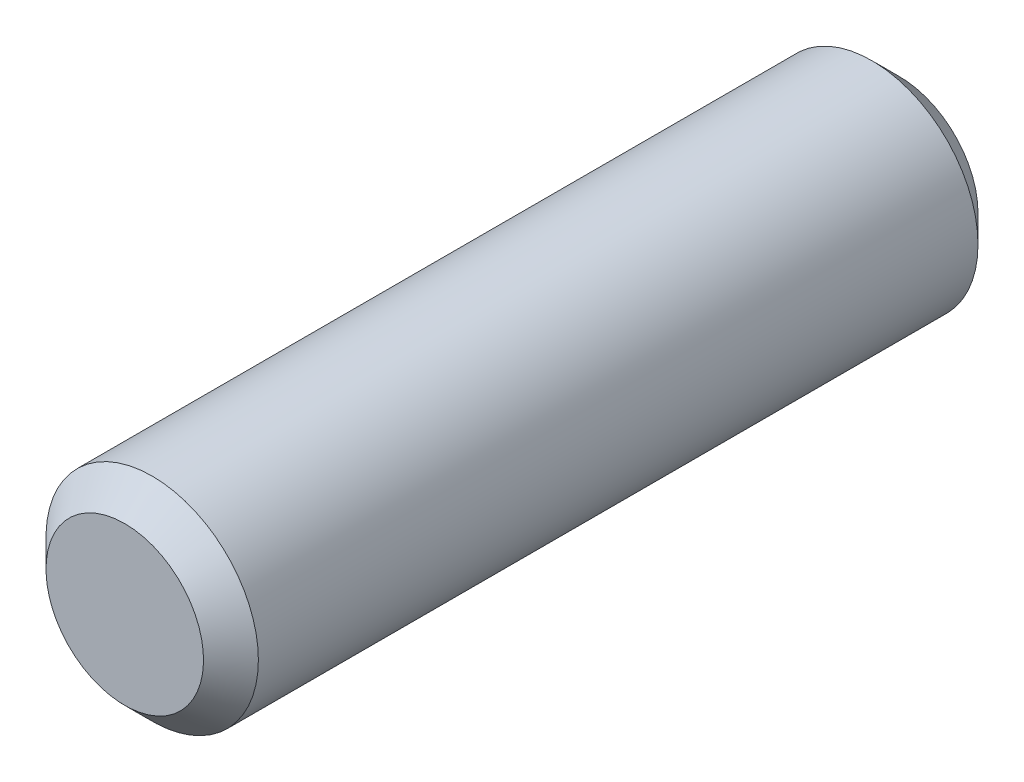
ISO-10303-21;
HEADER;
FILE_DESCRIPTION(('STEP AP214'),'2;1');
FILE_NAME('part.step','',(''),(''),'','','');
FILE_SCHEMA(('AUTOMOTIVE_DESIGN { 1 0 10303 214 1 1 1 1 }'));
ENDSEC;
DATA;
#1=APPLICATION_CONTEXT('core data for automotive mechanical design processes');
#2=APPLICATION_PROTOCOL_DEFINITION('international standard','automotive_design',2000,#1);
#3=PRODUCT_CONTEXT('',#1,'mechanical');
#4=PRODUCT('Part','Part','',(#3));
#5=PRODUCT_RELATED_PRODUCT_CATEGORY('part','',(#4));
#6=PRODUCT_DEFINITION_FORMATION('','',#4);
#7=PRODUCT_DEFINITION_CONTEXT('part definition',#1,'design');
#8=PRODUCT_DEFINITION('design','',#6,#7);
#9=PRODUCT_DEFINITION_SHAPE('','',#8);
#10=(LENGTH_UNIT() NAMED_UNIT(*) SI_UNIT(.MILLI.,.METRE.));
#11=(NAMED_UNIT(*) PLANE_ANGLE_UNIT() SI_UNIT($,.RADIAN.));
#12=(NAMED_UNIT(*) SI_UNIT($,.STERADIAN.) SOLID_ANGLE_UNIT());
#13=UNCERTAINTY_MEASURE_WITH_UNIT(LENGTH_MEASURE(1.E-05),#10,'distance_accuracy_value','');
#14=(GEOMETRIC_REPRESENTATION_CONTEXT(3) GLOBAL_UNCERTAINTY_ASSIGNED_CONTEXT((#13)) GLOBAL_UNIT_ASSIGNED_CONTEXT((#10,
#11,#12)) REPRESENTATION_CONTEXT('',''));
#15=CARTESIAN_POINT('',(0.,0.,0.));
#16=DIRECTION('',(0.,0.,1.));
#17=DIRECTION('',(1.,0.,0.));
#18=AXIS2_PLACEMENT_3D('',#15,#16,#17);
#19=CARTESIAN_POINT('',(0.,0.,29.6418));
#20=DIRECTION('',(0.,0.,1.));
#21=DIRECTION('',(1.,0.,0.));
#22=AXIS2_PLACEMENT_3D('',#19,#20,#21);
#23=PLANE('',#22);
#24=CARTESIAN_POINT('',(0.,0.,29.6418));
#25=DIRECTION('',(0.,0.,-1.));
#26=DIRECTION('',(0.,1.,0.));
#27=AXIS2_PLACEMENT_3D('',#24,#25,#26);
#28=CIRCLE('',#27,3.01413333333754);
#29=CARTESIAN_POINT('',(0.,3.01413333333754,29.6418));
#30=VERTEX_POINT('',#29);
#31=EDGE_CURVE('E18',#30,#30,#28,.T.);
#32=ORIENTED_EDGE('',*,*,#31,.F.);
#33=EDGE_LOOP('',(#32));
#34=FACE_BOUND('',#33,.T.);
#35=ADVANCED_FACE('F15',(#34),#23,.T.);
#36=CARTESIAN_POINT('',(0.,0.,0.));
#37=DIRECTION('',(0.,0.,1.));
#38=DIRECTION('',(1.,0.,0.));
#39=AXIS2_PLACEMENT_3D('',#36,#37,#38);
#40=PLANE('',#39);
#41=CARTESIAN_POINT('',(0.,0.,0.));
#42=DIRECTION('',(0.,0.,1.));
#43=DIRECTION('',(1.,0.,0.));
#44=AXIS2_PLACEMENT_3D('',#41,#42,#43);
#45=CIRCLE('',#44,3.01413333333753);
#46=CARTESIAN_POINT('',(3.01413333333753,0.,0.));
#47=VERTEX_POINT('',#46);
#48=EDGE_CURVE('E27',#47,#47,#45,.T.);
#49=ORIENTED_EDGE('',*,*,#48,.F.);
#50=EDGE_LOOP('',(#49));
#51=FACE_BOUND('',#50,.T.);
#52=ADVANCED_FACE('F38',(#51),#40,.F.);
#53=CARTESIAN_POINT('',(0.,0.,28.5919333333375));
#54=DIRECTION('',(0.,0.,-1.));
#55=DIRECTION('',(0.,1.,0.));
#56=AXIS2_PLACEMENT_3D('',#53,#54,#55);
#57=CONICAL_SURFACE('',#56,4.064,0.785398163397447);
#58=CARTESIAN_POINT('',(0.,0.,28.5919333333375));
#59=DIRECTION('',(0.,0.,1.));
#60=DIRECTION('',(1.,0.,0.));
#61=AXIS2_PLACEMENT_3D('',#58,#59,#60);
#62=CIRCLE('',#61,4.064);
#63=CARTESIAN_POINT('',(4.064,0.,28.5919333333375));
#64=VERTEX_POINT('',#63);
#65=EDGE_CURVE('E22',#64,#64,#62,.F.);
#66=ORIENTED_EDGE('',*,*,#65,.F.);
#67=EDGE_LOOP('',(#66));
#68=FACE_BOUND('',#67,.T.);
#69=ORIENTED_EDGE('',*,*,#31,.T.);
#70=EDGE_LOOP('',(#69));
#71=FACE_BOUND('',#70,.T.);
#72=ADVANCED_FACE('F35',(#68,#71),#57,.T.);
#73=CARTESIAN_POINT('',(0.,0.,1.04986666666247));
#74=DIRECTION('',(0.,0.,1.));
#75=DIRECTION('',(1.,0.,0.));
#76=AXIS2_PLACEMENT_3D('',#73,#74,#75);
#77=CONICAL_SURFACE('',#76,4.064,0.785398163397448);
#78=CARTESIAN_POINT('',(0.,0.,1.04986666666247));
#79=DIRECTION('',(0.,0.,1.));
#80=DIRECTION('',(1.,0.,0.));
#81=AXIS2_PLACEMENT_3D('',#78,#79,#80);
#82=CIRCLE('',#81,4.064);
#83=CARTESIAN_POINT('',(4.064,0.,1.04986666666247));
#84=VERTEX_POINT('',#83);
#85=EDGE_CURVE('E10',#84,#84,#82,.T.);
#86=ORIENTED_EDGE('',*,*,#85,.F.);
#87=EDGE_LOOP('',(#86));
#88=FACE_BOUND('',#87,.T.);
#89=ORIENTED_EDGE('',*,*,#48,.T.);
#90=EDGE_LOOP('',(#89));
#91=FACE_BOUND('',#90,.T.);
#92=ADVANCED_FACE('F46',(#88,#91),#77,.T.);
#93=CARTESIAN_POINT('',(0.,0.,0.));
#94=DIRECTION('',(0.,0.,1.));
#95=DIRECTION('',(1.,0.,0.));
#96=AXIS2_PLACEMENT_3D('',#93,#94,#95);
#97=CYLINDRICAL_SURFACE('',#96,4.064);
#98=ORIENTED_EDGE('',*,*,#65,.T.);
#99=EDGE_LOOP('',(#98));
#100=FACE_BOUND('',#99,.T.);
#101=ORIENTED_EDGE('',*,*,#85,.T.);
#102=EDGE_LOOP('',(#101));
#103=FACE_BOUND('',#102,.T.);
#104=ADVANCED_FACE('F44',(#100,#103),#97,.T.);
#105=CLOSED_SHELL('',(#35,#52,#72,#92,#104));
#106=MANIFOLD_SOLID_BREP('B1',#105);
#107=ADVANCED_BREP_SHAPE_REPRESENTATION('',(#18,#106),#14);
#108=SHAPE_DEFINITION_REPRESENTATION(#9,#107);
ENDSEC;
END-ISO-10303-21;
